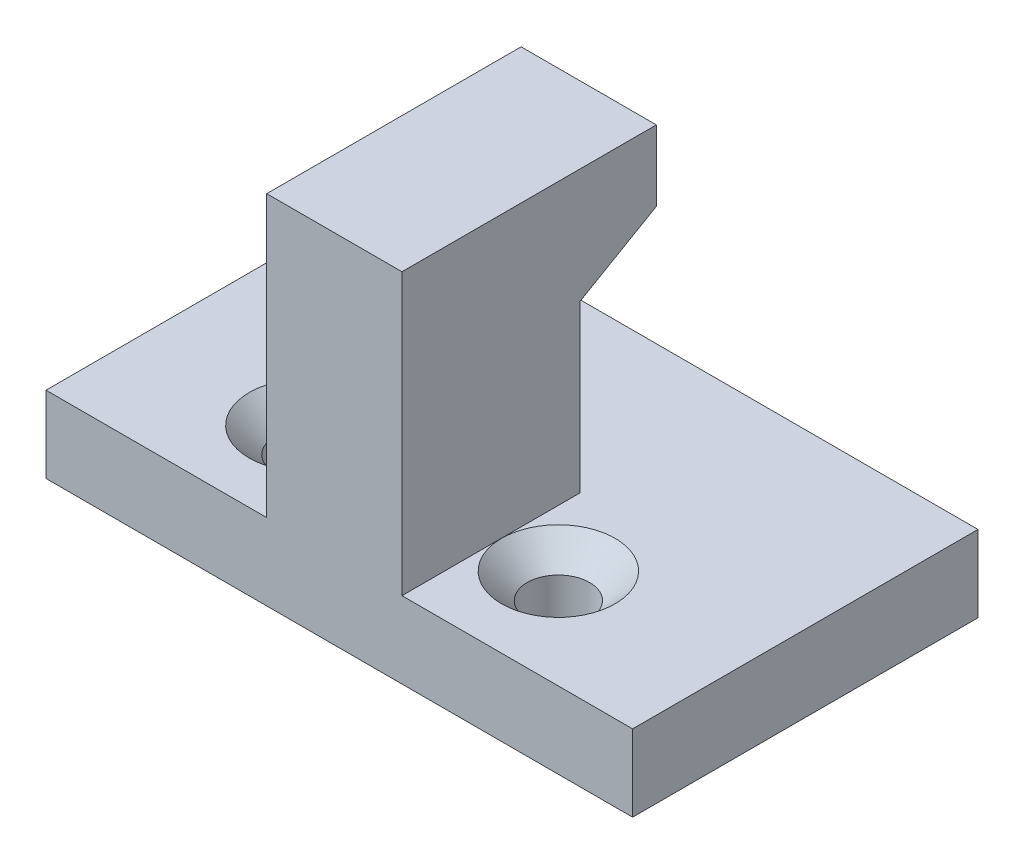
ISO-10303-21;
HEADER;
FILE_DESCRIPTION(('STEP AP214'),'2;1');
FILE_NAME('part.step','',(''),(''),'','','');
FILE_SCHEMA(('AUTOMOTIVE_DESIGN { 1 0 10303 214 1 1 1 1 }'));
ENDSEC;
DATA;
#1=APPLICATION_CONTEXT('core data for automotive mechanical design processes');
#2=APPLICATION_PROTOCOL_DEFINITION('international standard','automotive_design',2000,#1);
#3=PRODUCT_CONTEXT('',#1,'mechanical');
#4=PRODUCT('Part','Part','',(#3));
#5=PRODUCT_RELATED_PRODUCT_CATEGORY('part','',(#4));
#6=PRODUCT_DEFINITION_FORMATION('','',#4);
#7=PRODUCT_DEFINITION_CONTEXT('part definition',#1,'design');
#8=PRODUCT_DEFINITION('design','',#6,#7);
#9=PRODUCT_DEFINITION_SHAPE('','',#8);
#10=(LENGTH_UNIT() NAMED_UNIT(*) SI_UNIT(.MILLI.,.METRE.));
#11=(NAMED_UNIT(*) PLANE_ANGLE_UNIT() SI_UNIT($,.RADIAN.));
#12=(NAMED_UNIT(*) SI_UNIT($,.STERADIAN.) SOLID_ANGLE_UNIT());
#13=UNCERTAINTY_MEASURE_WITH_UNIT(LENGTH_MEASURE(1.E-05),#10,'distance_accuracy_value','');
#14=(GEOMETRIC_REPRESENTATION_CONTEXT(3) GLOBAL_UNCERTAINTY_ASSIGNED_CONTEXT((#13)) GLOBAL_UNIT_ASSIGNED_CONTEXT((#10,
#11,#12)) REPRESENTATION_CONTEXT('',''));
#15=CARTESIAN_POINT('',(0.,0.,0.));
#16=DIRECTION('',(0.,0.,1.));
#17=DIRECTION('',(1.,0.,0.));
#18=AXIS2_PLACEMENT_3D('',#15,#16,#17);
#19=CARTESIAN_POINT('',(-24.8199198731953,14.,-21.6712203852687));
#20=DIRECTION('',(0.,0.,1.));
#21=DIRECTION('',(1.,0.,0.));
#22=AXIS2_PLACEMENT_3D('',#19,#20,#21);
#23=PLANE('',#22);
#24=DIRECTION('',(-1.,0.,0.));
#25=VECTOR('',#24,1.);
#26=CARTESIAN_POINT('',(-24.8199198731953,9.5,-21.6712203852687));
#27=LINE('',#26,#25);
#28=CARTESIAN_POINT('',(-24.8199198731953,9.5,-21.6712203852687));
#29=VERTEX_POINT('',#28);
#30=CARTESIAN_POINT('',(-30.1221179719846,9.5,-21.6712203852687));
#31=VERTEX_POINT('',#30);
#32=EDGE_CURVE('E73',#29,#31,#27,.T.);
#33=ORIENTED_EDGE('',*,*,#32,.F.);
#34=DIRECTION('',(0.,-1.,0.));
#35=VECTOR('',#34,1.);
#36=CARTESIAN_POINT('',(-24.8199198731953,14.,-21.6712203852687));
#37=LINE('',#36,#35);
#38=CARTESIAN_POINT('',(-24.8199198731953,3.,-21.6712203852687));
#39=VERTEX_POINT('',#38);
#40=EDGE_CURVE('E54',#29,#39,#37,.T.);
#41=ORIENTED_EDGE('',*,*,#40,.T.);
#42=DIRECTION('',(-1.,0.,0.));
#43=VECTOR('',#42,1.);
#44=CARTESIAN_POINT('',(-24.8199198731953,3.,-21.6712203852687));
#45=LINE('',#44,#43);
#46=CARTESIAN_POINT('',(-30.1221179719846,3.,-21.6712203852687));
#47=VERTEX_POINT('',#46);
#48=EDGE_CURVE('E138',#39,#47,#45,.T.);
#49=ORIENTED_EDGE('',*,*,#48,.T.);
#50=DIRECTION('',(0.,-1.,0.));
#51=VECTOR('',#50,1.);
#52=CARTESIAN_POINT('',(-30.1221179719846,14.,-21.6712203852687));
#53=LINE('',#52,#51);
#54=EDGE_CURVE('E136',#31,#47,#53,.T.);
#55=ORIENTED_EDGE('',*,*,#54,.F.);
#56=EDGE_LOOP('',(#33,#41,#49,#55));
#57=FACE_BOUND('',#56,.T.);
#58=ADVANCED_FACE('F35',(#57),#23,.F.);
#59=CARTESIAN_POINT('',(0.,3.,0.));
#60=DIRECTION('',(0.,1.,0.));
#61=DIRECTION('',(0.,0.,1.));
#62=AXIS2_PLACEMENT_3D('',#59,#60,#61);
#63=PLANE('',#62);
#64=DIRECTION('',(0.,0.,-1.));
#65=VECTOR('',#64,1.);
#66=CARTESIAN_POINT('',(-24.8199198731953,3.,-14.6976816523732));
#67=LINE('',#66,#65);
#68=CARTESIAN_POINT('',(-24.8199198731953,3.,-14.6976816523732));
#69=VERTEX_POINT('',#68);
#70=EDGE_CURVE('E189',#69,#39,#67,.T.);
#71=ORIENTED_EDGE('',*,*,#70,.F.);
#72=DIRECTION('',(1.,0.,0.));
#73=VECTOR('',#72,1.);
#74=CARTESIAN_POINT('',(-38.7766062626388,3.,-14.6976816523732));
#75=LINE('',#74,#73);
#76=CARTESIAN_POINT('',(-15.7766062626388,3.,-14.6976816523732));
#77=VERTEX_POINT('',#76);
#78=EDGE_CURVE('E127',#69,#77,#75,.T.);
#79=ORIENTED_EDGE('',*,*,#78,.T.);
#80=DIRECTION('',(0.,0.,-1.));
#81=VECTOR('',#80,1.);
#82=CARTESIAN_POINT('',(-15.7766062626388,3.,-28.240021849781));
#83=LINE('',#82,#81);
#84=CARTESIAN_POINT('',(-15.7766062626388,3.,-28.240021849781));
#85=VERTEX_POINT('',#84);
#86=EDGE_CURVE('E126',#77,#85,#83,.T.);
#87=ORIENTED_EDGE('',*,*,#86,.T.);
#88=DIRECTION('',(-1.,0.,0.));
#89=VECTOR('',#88,1.);
#90=CARTESIAN_POINT('',(-38.7766062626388,3.,-28.240021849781));
#91=LINE('',#90,#89);
#92=CARTESIAN_POINT('',(-38.7766062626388,3.,-28.240021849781));
#93=VERTEX_POINT('',#92);
#94=EDGE_CURVE('E160',#85,#93,#91,.T.);
#95=ORIENTED_EDGE('',*,*,#94,.T.);
#96=DIRECTION('',(0.,0.,1.));
#97=VECTOR('',#96,1.);
#98=CARTESIAN_POINT('',(-38.7766062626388,3.,-28.240021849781));
#99=LINE('',#98,#97);
#100=CARTESIAN_POINT('',(-38.7766062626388,3.,-14.6976816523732));
#101=VERTEX_POINT('',#100);
#102=EDGE_CURVE('E121',#93,#101,#99,.T.);
#103=ORIENTED_EDGE('',*,*,#102,.T.);
#104=CARTESIAN_POINT('',(-30.1221179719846,3.,-14.6976816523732));
#105=VERTEX_POINT('',#104);
#106=EDGE_CURVE('E115',#101,#105,#75,.T.);
#107=ORIENTED_EDGE('',*,*,#106,.T.);
#108=DIRECTION('',(0.,0.,1.));
#109=VECTOR('',#108,1.);
#110=CARTESIAN_POINT('',(-30.1221179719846,3.,-14.6976816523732));
#111=LINE('',#110,#109);
#112=EDGE_CURVE('E119',#47,#105,#111,.T.);
#113=ORIENTED_EDGE('',*,*,#112,.F.);
#114=ORIENTED_EDGE('',*,*,#48,.F.);
#115=EDGE_LOOP('',(#71,#79,#87,#95,#103,#107,#113,#114));
#116=FACE_BOUND('',#115,.T.);
#117=CARTESIAN_POINT('',(-22.5895964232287,3.,-18.6));
#118=DIRECTION('',(0.,1.,0.));
#119=DIRECTION('',(0.,0.,1.));
#120=AXIS2_PLACEMENT_3D('',#117,#118,#119);
#121=CIRCLE('',#120,2.22510190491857);
#122=CARTESIAN_POINT('',(-22.5895964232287,3.,-16.3748980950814));
#123=VERTEX_POINT('',#122);
#124=EDGE_CURVE('E45',#123,#123,#121,.F.);
#125=ORIENTED_EDGE('',*,*,#124,.T.);
#126=EDGE_LOOP('',(#125));
#127=FACE_BOUND('',#126,.T.);
#128=CARTESIAN_POINT('',(-32.4895964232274,3.,-18.6));
#129=DIRECTION('',(0.,1.,0.));
#130=DIRECTION('',(0.,0.,1.));
#131=AXIS2_PLACEMENT_3D('',#128,#129,#130);
#132=CIRCLE('',#131,2.22510190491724);
#133=CARTESIAN_POINT('',(-32.4895964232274,3.,-16.3748980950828));
#134=VERTEX_POINT('',#133);
#135=EDGE_CURVE('E183',#134,#134,#132,.F.);
#136=ORIENTED_EDGE('',*,*,#135,.T.);
#137=EDGE_LOOP('',(#136));
#138=FACE_BOUND('',#137,.T.);
#139=ADVANCED_FACE('F117',(#116,#127,#138),#63,.T.);
#140=CARTESIAN_POINT('',(0.,0.,0.));
#141=DIRECTION('',(0.,1.,0.));
#142=DIRECTION('',(0.,0.,1.));
#143=AXIS2_PLACEMENT_3D('',#140,#141,#142);
#144=PLANE('',#143);
#145=DIRECTION('',(0.,0.,1.));
#146=VECTOR('',#145,1.);
#147=CARTESIAN_POINT('',(-38.7766062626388,0.,-28.240021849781));
#148=LINE('',#147,#146);
#149=CARTESIAN_POINT('',(-38.7766062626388,0.,-28.240021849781));
#150=VERTEX_POINT('',#149);
#151=CARTESIAN_POINT('',(-38.7766062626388,0.,-14.6976816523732));
#152=VERTEX_POINT('',#151);
#153=EDGE_CURVE('E156',#150,#152,#148,.T.);
#154=ORIENTED_EDGE('',*,*,#153,.F.);
#155=DIRECTION('',(-1.,0.,0.));
#156=VECTOR('',#155,1.);
#157=CARTESIAN_POINT('',(-38.7766062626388,0.,-28.240021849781));
#158=LINE('',#157,#156);
#159=CARTESIAN_POINT('',(-15.7766062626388,0.,-28.240021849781));
#160=VERTEX_POINT('',#159);
#161=EDGE_CURVE('E157',#160,#150,#158,.T.);
#162=ORIENTED_EDGE('',*,*,#161,.F.);
#163=DIRECTION('',(0.,0.,-1.));
#164=VECTOR('',#163,1.);
#165=CARTESIAN_POINT('',(-15.7766062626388,0.,-28.240021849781));
#166=LINE('',#165,#164);
#167=CARTESIAN_POINT('',(-15.7766062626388,0.,-14.6976816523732));
#168=VERTEX_POINT('',#167);
#169=EDGE_CURVE('E167',#168,#160,#166,.T.);
#170=ORIENTED_EDGE('',*,*,#169,.F.);
#171=DIRECTION('',(1.,0.,0.));
#172=VECTOR('',#171,1.);
#173=CARTESIAN_POINT('',(-38.7766062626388,0.,-14.6976816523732));
#174=LINE('',#173,#172);
#175=EDGE_CURVE('E165',#152,#168,#174,.T.);
#176=ORIENTED_EDGE('',*,*,#175,.F.);
#177=EDGE_LOOP('',(#154,#162,#170,#176));
#178=FACE_BOUND('',#177,.T.);
#179=CARTESIAN_POINT('',(-22.5895964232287,0.,-18.6));
#180=DIRECTION('',(0.,1.,0.));
#181=DIRECTION('',(0.,0.,1.));
#182=AXIS2_PLACEMENT_3D('',#179,#180,#181);
#183=CIRCLE('',#182,1.22510190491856);
#184=CARTESIAN_POINT('',(-22.5895964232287,0.,-17.3748980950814));
#185=VERTEX_POINT('',#184);
#186=EDGE_CURVE('E153',#185,#185,#183,.T.);
#187=ORIENTED_EDGE('',*,*,#186,.T.);
#188=EDGE_LOOP('',(#187));
#189=FACE_BOUND('',#188,.T.);
#190=CARTESIAN_POINT('',(-32.4895964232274,0.,-18.6));
#191=DIRECTION('',(0.,1.,0.));
#192=DIRECTION('',(0.,0.,1.));
#193=AXIS2_PLACEMENT_3D('',#190,#191,#192);
#194=CIRCLE('',#193,1.22510190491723);
#195=CARTESIAN_POINT('',(-32.4895964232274,0.,-17.3748980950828));
#196=VERTEX_POINT('',#195);
#197=EDGE_CURVE('E150',#196,#196,#194,.T.);
#198=ORIENTED_EDGE('',*,*,#197,.T.);
#199=EDGE_LOOP('',(#198));
#200=FACE_BOUND('',#199,.T.);
#201=ADVANCED_FACE('F229',(#178,#189,#200),#144,.F.);
#202=CARTESIAN_POINT('',(-38.7766062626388,3.,-28.240021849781));
#203=DIRECTION('',(1.,0.,0.));
#204=DIRECTION('',(0.,0.,-1.));
#205=AXIS2_PLACEMENT_3D('',#202,#203,#204);
#206=PLANE('',#205);
#207=ORIENTED_EDGE('',*,*,#153,.T.);
#208=DIRECTION('',(0.,-1.,0.));
#209=VECTOR('',#208,1.);
#210=CARTESIAN_POINT('',(-38.7766062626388,3.,-14.6976816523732));
#211=LINE('',#210,#209);
#212=EDGE_CURVE('E178',#101,#152,#211,.T.);
#213=ORIENTED_EDGE('',*,*,#212,.F.);
#214=ORIENTED_EDGE('',*,*,#102,.F.);
#215=DIRECTION('',(0.,-1.,0.));
#216=VECTOR('',#215,1.);
#217=CARTESIAN_POINT('',(-38.7766062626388,3.,-28.240021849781));
#218=LINE('',#217,#216);
#219=EDGE_CURVE('E162',#93,#150,#218,.T.);
#220=ORIENTED_EDGE('',*,*,#219,.T.);
#221=EDGE_LOOP('',(#207,#213,#214,#220));
#222=FACE_BOUND('',#221,.T.);
#223=ADVANCED_FACE('F227',(#222),#206,.F.);
#224=CARTESIAN_POINT('',(-38.7766062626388,3.,-14.6976816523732));
#225=DIRECTION('',(0.,0.,-1.));
#226=DIRECTION('',(-1.,0.,0.));
#227=AXIS2_PLACEMENT_3D('',#224,#225,#226);
#228=PLANE('',#227);
#229=ORIENTED_EDGE('',*,*,#175,.T.);
#230=DIRECTION('',(0.,-1.,0.));
#231=VECTOR('',#230,1.);
#232=CARTESIAN_POINT('',(-15.7766062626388,3.,-14.6976816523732));
#233=LINE('',#232,#231);
#234=EDGE_CURVE('E175',#77,#168,#233,.T.);
#235=ORIENTED_EDGE('',*,*,#234,.F.);
#236=ORIENTED_EDGE('',*,*,#78,.F.);
#237=DIRECTION('',(0.,-1.,0.));
#238=VECTOR('',#237,1.);
#239=CARTESIAN_POINT('',(-24.8199198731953,14.,-14.6976816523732));
#240=LINE('',#239,#238);
#241=CARTESIAN_POINT('',(-24.8199198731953,14.,-14.6976816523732));
#242=VERTEX_POINT('',#241);
#243=EDGE_CURVE('E143',#242,#69,#240,.T.);
#244=ORIENTED_EDGE('',*,*,#243,.F.);
#245=DIRECTION('',(1.,0.,0.));
#246=VECTOR('',#245,1.);
#247=CARTESIAN_POINT('',(-24.8199198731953,14.,-14.6976816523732));
#248=LINE('',#247,#246);
#249=CARTESIAN_POINT('',(-30.1221179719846,14.,-14.6976816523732));
#250=VERTEX_POINT('',#249);
#251=EDGE_CURVE('E142',#250,#242,#248,.T.);
#252=ORIENTED_EDGE('',*,*,#251,.F.);
#253=DIRECTION('',(0.,-1.,0.));
#254=VECTOR('',#253,1.);
#255=CARTESIAN_POINT('',(-30.1221179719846,14.,-14.6976816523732));
#256=LINE('',#255,#254);
#257=EDGE_CURVE('E133',#250,#105,#256,.T.);
#258=ORIENTED_EDGE('',*,*,#257,.T.);
#259=ORIENTED_EDGE('',*,*,#106,.F.);
#260=ORIENTED_EDGE('',*,*,#212,.T.);
#261=EDGE_LOOP('',(#229,#235,#236,#244,#252,#258,#259,#260));
#262=FACE_BOUND('',#261,.T.);
#263=ADVANCED_FACE('F140',(#262),#228,.F.);
#264=CARTESIAN_POINT('',(-15.7766062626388,3.,-28.240021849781));
#265=DIRECTION('',(-1.,0.,0.));
#266=DIRECTION('',(0.,0.,1.));
#267=AXIS2_PLACEMENT_3D('',#264,#265,#266);
#268=PLANE('',#267);
#269=ORIENTED_EDGE('',*,*,#169,.T.);
#270=DIRECTION('',(0.,-1.,0.));
#271=VECTOR('',#270,1.);
#272=CARTESIAN_POINT('',(-15.7766062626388,3.,-28.240021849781));
#273=LINE('',#272,#271);
#274=EDGE_CURVE('E172',#85,#160,#273,.T.);
#275=ORIENTED_EDGE('',*,*,#274,.F.);
#276=ORIENTED_EDGE('',*,*,#86,.F.);
#277=ORIENTED_EDGE('',*,*,#234,.T.);
#278=EDGE_LOOP('',(#269,#275,#276,#277));
#279=FACE_BOUND('',#278,.T.);
#280=ADVANCED_FACE('F220',(#279),#268,.F.);
#281=CARTESIAN_POINT('',(-38.7766062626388,3.,-28.240021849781));
#282=DIRECTION('',(0.,0.,1.));
#283=DIRECTION('',(1.,0.,0.));
#284=AXIS2_PLACEMENT_3D('',#281,#282,#283);
#285=PLANE('',#284);
#286=ORIENTED_EDGE('',*,*,#161,.T.);
#287=ORIENTED_EDGE('',*,*,#219,.F.);
#288=ORIENTED_EDGE('',*,*,#94,.F.);
#289=ORIENTED_EDGE('',*,*,#274,.T.);
#290=EDGE_LOOP('',(#286,#287,#288,#289));
#291=FACE_BOUND('',#290,.T.);
#292=ADVANCED_FACE('F224',(#291),#285,.F.);
#293=CARTESIAN_POINT('',(-22.5895964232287,3.,-18.6));
#294=DIRECTION('',(0.,-1.,0.));
#295=DIRECTION('',(0.,0.,-1.));
#296=AXIS2_PLACEMENT_3D('',#293,#294,#295);
#297=CYLINDRICAL_SURFACE('',#296,1.22510190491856);
#298=CARTESIAN_POINT('',(-22.5895964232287,2.,-18.6));
#299=DIRECTION('',(0.,1.,0.));
#300=DIRECTION('',(0.,0.,1.));
#301=AXIS2_PLACEMENT_3D('',#298,#299,#300);
#302=CIRCLE('',#301,1.22510190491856);
#303=CARTESIAN_POINT('',(-22.5895964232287,2.,-17.3748980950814));
#304=VERTEX_POINT('',#303);
#305=EDGE_CURVE('E180',#304,#304,#302,.T.);
#306=ORIENTED_EDGE('',*,*,#305,.T.);
#307=EDGE_LOOP('',(#306));
#308=FACE_BOUND('',#307,.T.);
#309=ORIENTED_EDGE('',*,*,#186,.F.);
#310=EDGE_LOOP('',(#309));
#311=FACE_BOUND('',#310,.T.);
#312=ADVANCED_FACE('F240',(#308,#311),#297,.F.);
#313=CARTESIAN_POINT('',(-32.4895964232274,3.,-18.6));
#314=DIRECTION('',(0.,-1.,0.));
#315=DIRECTION('',(0.,0.,-1.));
#316=AXIS2_PLACEMENT_3D('',#313,#314,#315);
#317=CYLINDRICAL_SURFACE('',#316,1.22510190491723);
#318=CARTESIAN_POINT('',(-32.4895964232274,1.99999999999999,-18.6));
#319=DIRECTION('',(0.,1.,0.));
#320=DIRECTION('',(0.,0.,1.));
#321=AXIS2_PLACEMENT_3D('',#318,#319,#320);
#322=CIRCLE('',#321,1.22510190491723);
#323=CARTESIAN_POINT('',(-32.4895964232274,1.99999999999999,-17.3748980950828));
#324=VERTEX_POINT('',#323);
#325=EDGE_CURVE('E11',#324,#324,#322,.T.);
#326=ORIENTED_EDGE('',*,*,#325,.T.);
#327=EDGE_LOOP('',(#326));
#328=FACE_BOUND('',#327,.T.);
#329=ORIENTED_EDGE('',*,*,#197,.F.);
#330=EDGE_LOOP('',(#329));
#331=FACE_BOUND('',#330,.T.);
#332=ADVANCED_FACE('F237',(#328,#331),#317,.F.);
#333=CARTESIAN_POINT('',(-22.5895964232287,2.,-18.6));
#334=DIRECTION('',(0.,1.,0.));
#335=DIRECTION('',(0.,0.,1.));
#336=AXIS2_PLACEMENT_3D('',#333,#334,#335);
#337=CONICAL_SURFACE('',#336,1.22510190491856,0.78539816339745);
#338=ORIENTED_EDGE('',*,*,#124,.F.);
#339=EDGE_LOOP('',(#338));
#340=FACE_BOUND('',#339,.T.);
#341=ORIENTED_EDGE('',*,*,#305,.F.);
#342=EDGE_LOOP('',(#341));
#343=FACE_BOUND('',#342,.T.);
#344=ADVANCED_FACE('F239',(#340,#343),#337,.F.);
#345=CARTESIAN_POINT('',(-32.4895964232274,1.99999999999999,-18.6));
#346=DIRECTION('',(0.,1.,0.));
#347=DIRECTION('',(0.,0.,1.));
#348=AXIS2_PLACEMENT_3D('',#345,#346,#347);
#349=CONICAL_SURFACE('',#348,1.22510190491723,0.78539816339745);
#350=ORIENTED_EDGE('',*,*,#135,.F.);
#351=EDGE_LOOP('',(#350));
#352=FACE_BOUND('',#351,.T.);
#353=ORIENTED_EDGE('',*,*,#325,.F.);
#354=EDGE_LOOP('',(#353));
#355=FACE_BOUND('',#354,.T.);
#356=ADVANCED_FACE('F247',(#352,#355),#349,.F.);
#357=CARTESIAN_POINT('',(-24.8199198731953,14.,-14.6976816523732));
#358=DIRECTION('',(-1.,0.,0.));
#359=DIRECTION('',(0.,0.,1.));
#360=AXIS2_PLACEMENT_3D('',#357,#358,#359);
#361=PLANE('',#360);
#362=ORIENTED_EDGE('',*,*,#70,.T.);
#363=ORIENTED_EDGE('',*,*,#40,.F.);
#364=DIRECTION('',(0.,0.500000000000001,-0.866025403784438));
#365=VECTOR('',#364,1.);
#366=CARTESIAN_POINT('',(-24.8199198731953,9.5,-21.6712203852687));
#367=LINE('',#366,#365);
#368=CARTESIAN_POINT('',(-24.8199198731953,11.2320508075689,-24.6712203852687));
#369=VERTEX_POINT('',#368);
#370=EDGE_CURVE('E188',#369,#29,#367,.F.);
#371=ORIENTED_EDGE('',*,*,#370,.F.);
#372=DIRECTION('',(0.,-1.,0.));
#373=VECTOR('',#372,1.);
#374=CARTESIAN_POINT('',(-24.8199198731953,14.,-24.6712203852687));
#375=LINE('',#374,#373);
#376=CARTESIAN_POINT('',(-24.8199198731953,14.,-24.6712203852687));
#377=VERTEX_POINT('',#376);
#378=EDGE_CURVE('E191',#377,#369,#375,.T.);
#379=ORIENTED_EDGE('',*,*,#378,.F.);
#380=DIRECTION('',(0.,0.,-1.));
#381=VECTOR('',#380,1.);
#382=CARTESIAN_POINT('',(-24.8199198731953,14.,-14.6976816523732));
#383=LINE('',#382,#381);
#384=EDGE_CURVE('E137',#242,#377,#383,.T.);
#385=ORIENTED_EDGE('',*,*,#384,.F.);
#386=ORIENTED_EDGE('',*,*,#243,.T.);
#387=EDGE_LOOP('',(#362,#363,#371,#379,#385,#386));
#388=FACE_BOUND('',#387,.T.);
#389=ADVANCED_FACE('F212',(#388),#361,.F.);
#390=CARTESIAN_POINT('',(-30.1221179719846,14.,-14.6976816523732));
#391=DIRECTION('',(1.,0.,0.));
#392=DIRECTION('',(0.,0.,-1.));
#393=AXIS2_PLACEMENT_3D('',#390,#391,#392);
#394=PLANE('',#393);
#395=ORIENTED_EDGE('',*,*,#112,.T.);
#396=ORIENTED_EDGE('',*,*,#257,.F.);
#397=DIRECTION('',(0.,0.,1.));
#398=VECTOR('',#397,1.);
#399=CARTESIAN_POINT('',(-30.1221179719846,14.,-14.6976816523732));
#400=LINE('',#399,#398);
#401=CARTESIAN_POINT('',(-30.1221179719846,14.,-24.6712203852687));
#402=VERTEX_POINT('',#401);
#403=EDGE_CURVE('E205',#402,#250,#400,.T.);
#404=ORIENTED_EDGE('',*,*,#403,.F.);
#405=DIRECTION('',(0.,1.,0.));
#406=VECTOR('',#405,1.);
#407=CARTESIAN_POINT('',(-30.1221179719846,14.,-24.6712203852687));
#408=LINE('',#407,#406);
#409=CARTESIAN_POINT('',(-30.1221179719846,11.2320508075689,-24.6712203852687));
#410=VERTEX_POINT('',#409);
#411=EDGE_CURVE('E190',#410,#402,#408,.T.);
#412=ORIENTED_EDGE('',*,*,#411,.F.);
#413=DIRECTION('',(0.,0.500000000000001,-0.866025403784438));
#414=VECTOR('',#413,1.);
#415=CARTESIAN_POINT('',(-30.1221179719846,7.60536915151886,-18.389623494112));
#416=LINE('',#415,#414);
#417=EDGE_CURVE('E39',#410,#31,#416,.F.);
#418=ORIENTED_EDGE('',*,*,#417,.T.);
#419=ORIENTED_EDGE('',*,*,#54,.T.);
#420=EDGE_LOOP('',(#395,#396,#404,#412,#418,#419));
#421=FACE_BOUND('',#420,.T.);
#422=ADVANCED_FACE('F131',(#421),#394,.F.);
#423=CARTESIAN_POINT('',(0.,14.,0.));
#424=DIRECTION('',(0.,1.,0.));
#425=DIRECTION('',(0.,0.,1.));
#426=AXIS2_PLACEMENT_3D('',#423,#424,#425);
#427=PLANE('',#426);
#428=ORIENTED_EDGE('',*,*,#384,.T.);
#429=DIRECTION('',(1.,0.,0.));
#430=VECTOR('',#429,1.);
#431=CARTESIAN_POINT('',(-24.8199198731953,14.,-24.6712203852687));
#432=LINE('',#431,#430);
#433=EDGE_CURVE('E194',#402,#377,#432,.T.);
#434=ORIENTED_EDGE('',*,*,#433,.F.);
#435=ORIENTED_EDGE('',*,*,#403,.T.);
#436=ORIENTED_EDGE('',*,*,#251,.T.);
#437=EDGE_LOOP('',(#428,#434,#435,#436));
#438=FACE_BOUND('',#437,.T.);
#439=ADVANCED_FACE('F266',(#438),#427,.T.);
#440=CARTESIAN_POINT('',(-24.8199198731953,9.5,-21.6712203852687));
#441=DIRECTION('',(0.,-0.866025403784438,-0.500000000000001));
#442=DIRECTION('',(0.,0.500000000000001,-0.866025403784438));
#443=AXIS2_PLACEMENT_3D('',#440,#441,#442);
#444=PLANE('',#443);
#445=ORIENTED_EDGE('',*,*,#32,.T.);
#446=ORIENTED_EDGE('',*,*,#417,.F.);
#447=DIRECTION('',(1.,0.,0.));
#448=VECTOR('',#447,1.);
#449=CARTESIAN_POINT('',(-24.8199198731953,11.2320508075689,-24.6712203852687));
#450=LINE('',#449,#448);
#451=EDGE_CURVE('E67',#369,#410,#450,.F.);
#452=ORIENTED_EDGE('',*,*,#451,.F.);
#453=ORIENTED_EDGE('',*,*,#370,.T.);
#454=EDGE_LOOP('',(#445,#446,#452,#453));
#455=FACE_BOUND('',#454,.T.);
#456=ADVANCED_FACE('F37',(#455),#444,.T.);
#457=CARTESIAN_POINT('',(0.,0.,-24.6712203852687));
#458=DIRECTION('',(0.,0.,-1.));
#459=DIRECTION('',(-1.,0.,0.));
#460=AXIS2_PLACEMENT_3D('',#457,#458,#459);
#461=PLANE('',#460);
#462=ORIENTED_EDGE('',*,*,#378,.T.);
#463=ORIENTED_EDGE('',*,*,#451,.T.);
#464=ORIENTED_EDGE('',*,*,#411,.T.);
#465=ORIENTED_EDGE('',*,*,#433,.T.);
#466=EDGE_LOOP('',(#462,#463,#464,#465));
#467=FACE_BOUND('',#466,.T.);
#468=ADVANCED_FACE('F350',(#467),#461,.T.);
#469=CLOSED_SHELL('',(#58,#139,#201,#223,#263,#280,#292,#312,#332,#344,#356,#389,#422,#439,#456,#468));
#470=MANIFOLD_SOLID_BREP('B2',#469);
#471=ADVANCED_BREP_SHAPE_REPRESENTATION('',(#18,#470),#14);
#472=SHAPE_DEFINITION_REPRESENTATION(#9,#471);
ENDSEC;
END-ISO-10303-21;
